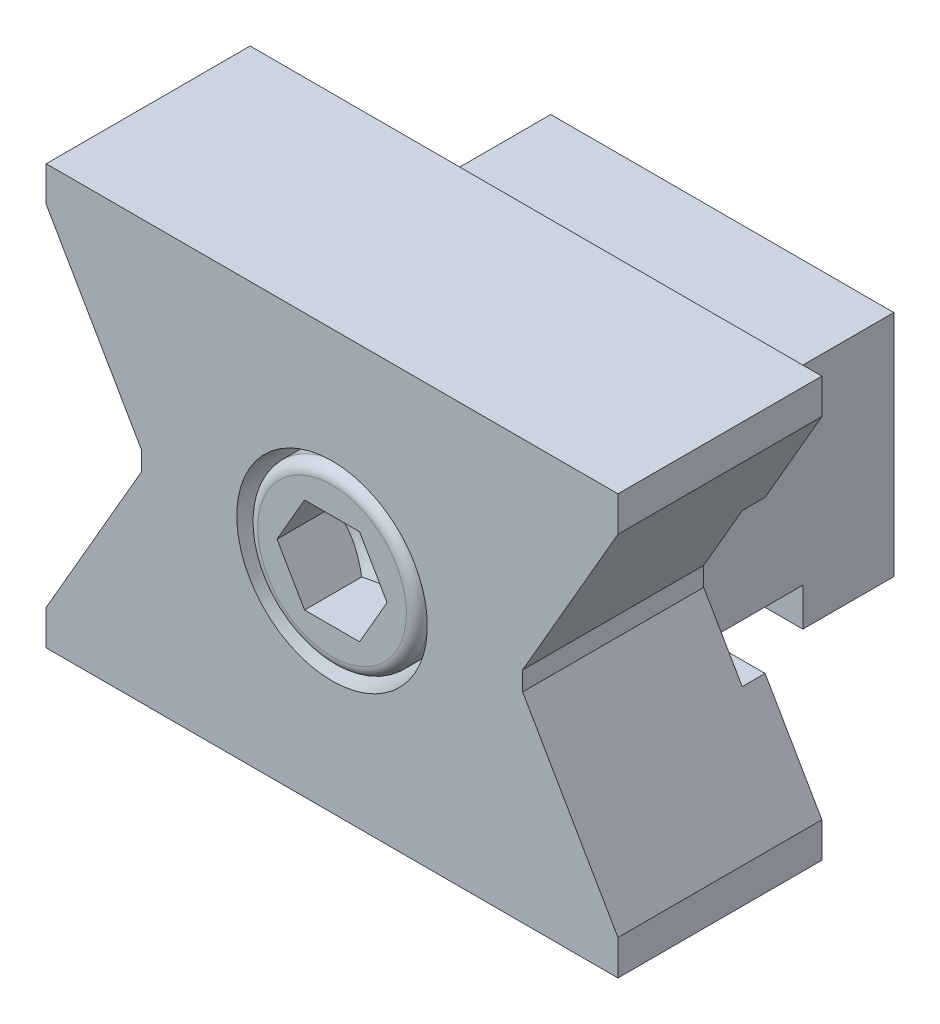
ISO-10303-21;
HEADER;
FILE_DESCRIPTION(('STEP AP214'),'2;1');
FILE_NAME('part.step','',(''),(''),'','','');
FILE_SCHEMA(('AUTOMOTIVE_DESIGN { 1 0 10303 214 1 1 1 1 }'));
ENDSEC;
DATA;
#1=APPLICATION_CONTEXT('core data for automotive mechanical design processes');
#2=APPLICATION_PROTOCOL_DEFINITION('international standard','automotive_design',2000,#1);
#3=PRODUCT_CONTEXT('',#1,'mechanical');
#4=PRODUCT('Part','Part','',(#3));
#5=PRODUCT_RELATED_PRODUCT_CATEGORY('part','',(#4));
#6=PRODUCT_DEFINITION_FORMATION('','',#4);
#7=PRODUCT_DEFINITION_CONTEXT('part definition',#1,'design');
#8=PRODUCT_DEFINITION('design','',#6,#7);
#9=PRODUCT_DEFINITION_SHAPE('','',#8);
#10=(LENGTH_UNIT() NAMED_UNIT(*) SI_UNIT(.MILLI.,.METRE.));
#11=(NAMED_UNIT(*) PLANE_ANGLE_UNIT() SI_UNIT($,.RADIAN.));
#12=(NAMED_UNIT(*) SI_UNIT($,.STERADIAN.) SOLID_ANGLE_UNIT());
#13=UNCERTAINTY_MEASURE_WITH_UNIT(LENGTH_MEASURE(1.E-05),#10,'distance_accuracy_value','');
#14=(GEOMETRIC_REPRESENTATION_CONTEXT(3) GLOBAL_UNCERTAINTY_ASSIGNED_CONTEXT((#13)) GLOBAL_UNIT_ASSIGNED_CONTEXT((#10,
#11,#12)) REPRESENTATION_CONTEXT('',''));
#15=CARTESIAN_POINT('',(0.,0.,0.));
#16=DIRECTION('',(0.,0.,1.));
#17=DIRECTION('',(1.,0.,0.));
#18=AXIS2_PLACEMENT_3D('',#15,#16,#17);
#19=CARTESIAN_POINT('',(0.,0.,-7.7875));
#20=DIRECTION('',(0.,0.,-1.));
#21=DIRECTION('',(-0.866025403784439,0.5,0.));
#22=AXIS2_PLACEMENT_3D('',#19,#20,#21);
#23=CYLINDRICAL_SURFACE('',#22,6.);
#24=CARTESIAN_POINT('',(0.,0.,2.00000000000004));
#25=DIRECTION('',(0.,0.,1.));
#26=DIRECTION('',(0.,-1.,0.));
#27=AXIS2_PLACEMENT_3D('',#24,#25,#26);
#28=CIRCLE('',#27,6.);
#29=CARTESIAN_POINT('',(0.,-5.99999999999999,2.00000000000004));
#30=VERTEX_POINT('',#29);
#31=EDGE_CURVE('E158',#30,#30,#28,.F.);
#32=ORIENTED_EDGE('',*,*,#31,.F.);
#33=EDGE_LOOP('',(#32));
#34=FACE_BOUND('',#33,.T.);
#35=CARTESIAN_POINT('',(0.,0.,2.4));
#36=DIRECTION('',(0.,0.,1.));
#37=DIRECTION('',(1.,0.,0.));
#38=AXIS2_PLACEMENT_3D('',#35,#36,#37);
#39=CIRCLE('',#38,6.);
#40=CARTESIAN_POINT('',(6.,0.,2.4));
#41=VERTEX_POINT('',#40);
#42=EDGE_CURVE('E18',#41,#41,#39,.F.);
#43=ORIENTED_EDGE('',*,*,#42,.T.);
#44=EDGE_LOOP('',(#43));
#45=FACE_BOUND('',#44,.T.);
#46=ADVANCED_FACE('F14',(#34,#45),#23,.T.);
#47=CARTESIAN_POINT('',(-20.,22.,21.4));
#48=DIRECTION('',(0.,0.,1.));
#49=DIRECTION('',(0.,-1.,0.));
#50=AXIS2_PLACEMENT_3D('',#47,#48,#49);
#51=PLANE('',#50);
#52=CARTESIAN_POINT('',(0.,0.,21.4));
#53=DIRECTION('',(0.,0.,1.));
#54=DIRECTION('',(0.,-1.,0.));
#55=AXIS2_PLACEMENT_3D('',#52,#53,#54);
#56=CIRCLE('',#55,10.);
#57=CARTESIAN_POINT('',(0.,-9.99999999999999,21.4));
#58=VERTEX_POINT('',#57);
#59=EDGE_CURVE('E223',#58,#58,#56,.F.);
#60=ORIENTED_EDGE('',*,*,#59,.T.);
#61=EDGE_LOOP('',(#60));
#62=FACE_BOUND('',#61,.T.);
#63=DIRECTION('',(-0.5,0.866025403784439,0.));
#64=VECTOR('',#63,1.);
#65=CARTESIAN_POINT('',(30.,-18.3205080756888,21.4));
#66=LINE('',#65,#64);
#67=CARTESIAN_POINT('',(30.,-18.3205080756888,21.4));
#68=VERTEX_POINT('',#67);
#69=CARTESIAN_POINT('',(20.,-0.999999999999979,21.4));
#70=VERTEX_POINT('',#69);
#71=EDGE_CURVE('E700',#68,#70,#66,.T.);
#72=ORIENTED_EDGE('',*,*,#71,.T.);
#73=DIRECTION('',(0.,-1.,0.));
#74=VECTOR('',#73,1.);
#75=CARTESIAN_POINT('',(20.,22.,21.4));
#76=LINE('',#75,#74);
#77=CARTESIAN_POINT('',(20.,1.00000000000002,21.4));
#78=VERTEX_POINT('',#77);
#79=EDGE_CURVE('E695',#70,#78,#76,.F.);
#80=ORIENTED_EDGE('',*,*,#79,.T.);
#81=DIRECTION('',(0.5,0.866025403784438,0.));
#82=VECTOR('',#81,1.);
#83=CARTESIAN_POINT('',(20.,1.00000000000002,21.4));
#84=LINE('',#83,#82);
#85=CARTESIAN_POINT('',(30.,18.3205080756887,21.4));
#86=VERTEX_POINT('',#85);
#87=EDGE_CURVE('E686',#78,#86,#84,.T.);
#88=ORIENTED_EDGE('',*,*,#87,.T.);
#89=DIRECTION('',(0.,-1.,0.));
#90=VECTOR('',#89,1.);
#91=CARTESIAN_POINT('',(30.,22.,21.4));
#92=LINE('',#91,#90);
#93=CARTESIAN_POINT('',(30.,22.,21.4));
#94=VERTEX_POINT('',#93);
#95=EDGE_CURVE('E684',#86,#94,#92,.F.);
#96=ORIENTED_EDGE('',*,*,#95,.T.);
#97=DIRECTION('',(1.,0.,0.));
#98=VECTOR('',#97,1.);
#99=CARTESIAN_POINT('',(-20.,22.,21.4));
#100=LINE('',#99,#98);
#101=CARTESIAN_POINT('',(-30.,22.,21.4));
#102=VERTEX_POINT('',#101);
#103=EDGE_CURVE('E722',#94,#102,#100,.F.);
#104=ORIENTED_EDGE('',*,*,#103,.T.);
#105=DIRECTION('',(0.,-1.,0.));
#106=VECTOR('',#105,1.);
#107=CARTESIAN_POINT('',(-30.,22.,21.4));
#108=LINE('',#107,#106);
#109=CARTESIAN_POINT('',(-30.,18.3205080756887,21.4));
#110=VERTEX_POINT('',#109);
#111=EDGE_CURVE('E719',#102,#110,#108,.T.);
#112=ORIENTED_EDGE('',*,*,#111,.T.);
#113=DIRECTION('',(0.5,-0.866025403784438,0.));
#114=VECTOR('',#113,1.);
#115=CARTESIAN_POINT('',(-30.,18.3205080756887,21.4));
#116=LINE('',#115,#114);
#117=CARTESIAN_POINT('',(-20.,1.00000000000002,21.4));
#118=VERTEX_POINT('',#117);
#119=EDGE_CURVE('E716',#110,#118,#116,.T.);
#120=ORIENTED_EDGE('',*,*,#119,.T.);
#121=DIRECTION('',(0.,-1.,0.));
#122=VECTOR('',#121,1.);
#123=CARTESIAN_POINT('',(-20.,22.,21.4));
#124=LINE('',#123,#122);
#125=CARTESIAN_POINT('',(-20.,-0.999999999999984,21.4));
#126=VERTEX_POINT('',#125);
#127=EDGE_CURVE('E713',#118,#126,#124,.T.);
#128=ORIENTED_EDGE('',*,*,#127,.T.);
#129=DIRECTION('',(-0.5,-0.866025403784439,0.));
#130=VECTOR('',#129,1.);
#131=CARTESIAN_POINT('',(-20.,-0.999999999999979,21.4));
#132=LINE('',#131,#130);
#133=CARTESIAN_POINT('',(-30.,-18.3205080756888,21.4));
#134=VERTEX_POINT('',#133);
#135=EDGE_CURVE('E711',#126,#134,#132,.T.);
#136=ORIENTED_EDGE('',*,*,#135,.T.);
#137=DIRECTION('',(0.,-1.,0.));
#138=VECTOR('',#137,1.);
#139=CARTESIAN_POINT('',(-30.,22.,21.4));
#140=LINE('',#139,#138);
#141=CARTESIAN_POINT('',(-30.,-22.,21.4));
#142=VERTEX_POINT('',#141);
#143=EDGE_CURVE('E646',#134,#142,#140,.T.);
#144=ORIENTED_EDGE('',*,*,#143,.T.);
#145=DIRECTION('',(1.,0.,0.));
#146=VECTOR('',#145,1.);
#147=CARTESIAN_POINT('',(-20.,-22.,21.4));
#148=LINE('',#147,#146);
#149=CARTESIAN_POINT('',(30.,-22.,21.4));
#150=VERTEX_POINT('',#149);
#151=EDGE_CURVE('E707',#142,#150,#148,.T.);
#152=ORIENTED_EDGE('',*,*,#151,.T.);
#153=DIRECTION('',(0.,-1.,0.));
#154=VECTOR('',#153,1.);
#155=CARTESIAN_POINT('',(30.,22.,21.4));
#156=LINE('',#155,#154);
#157=EDGE_CURVE('E703',#150,#68,#156,.F.);
#158=ORIENTED_EDGE('',*,*,#157,.T.);
#159=EDGE_LOOP('',(#72,#80,#88,#96,#104,#112,#120,#128,#136,#144,#152,#158));
#160=FACE_BOUND('',#159,.T.);
#161=ADVANCED_FACE('F397',(#62,#160),#51,.T.);
#162=CARTESIAN_POINT('',(0.,0.,15.4));
#163=DIRECTION('',(0.,0.,1.));
#164=DIRECTION('',(0.,-1.,0.));
#165=AXIS2_PLACEMENT_3D('',#162,#163,#164);
#166=CYLINDRICAL_SURFACE('',#165,10.);
#167=CARTESIAN_POINT('',(0.,0.,9.4));
#168=DIRECTION('',(0.,0.,1.));
#169=DIRECTION('',(0.,-1.,0.));
#170=AXIS2_PLACEMENT_3D('',#167,#168,#169);
#171=CIRCLE('',#170,10.);
#172=CARTESIAN_POINT('',(0.,-9.99999999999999,9.4));
#173=VERTEX_POINT('',#172);
#174=EDGE_CURVE('E226',#173,#173,#171,.T.);
#175=ORIENTED_EDGE('',*,*,#174,.F.);
#176=EDGE_LOOP('',(#175));
#177=FACE_BOUND('',#176,.T.);
#178=ORIENTED_EDGE('',*,*,#59,.F.);
#179=EDGE_LOOP('',(#178));
#180=FACE_BOUND('',#179,.T.);
#181=ADVANCED_FACE('F403',(#177,#180),#166,.F.);
#182=CARTESIAN_POINT('',(0.,0.,9.4));
#183=DIRECTION('',(0.,0.,1.));
#184=DIRECTION('',(0.,-1.,0.));
#185=AXIS2_PLACEMENT_3D('',#182,#183,#184);
#186=PLANE('',#185);
#187=ORIENTED_EDGE('',*,*,#174,.T.);
#188=EDGE_LOOP('',(#187));
#189=FACE_BOUND('',#188,.T.);
#190=CARTESIAN_POINT('',(0.,0.,9.4));
#191=DIRECTION('',(0.,0.,-1.));
#192=DIRECTION('',(-0.866025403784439,0.5,0.));
#193=AXIS2_PLACEMENT_3D('',#190,#191,#192);
#194=CIRCLE('',#193,9.);
#195=CARTESIAN_POINT('',(-7.79422863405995,4.50000000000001,9.4));
#196=VERTEX_POINT('',#195);
#197=EDGE_CURVE('E218',#196,#196,#194,.T.);
#198=ORIENTED_EDGE('',*,*,#197,.T.);
#199=EDGE_LOOP('',(#198));
#200=FACE_BOUND('',#199,.T.);
#201=ADVANCED_FACE('F784',(#189,#200),#186,.T.);
#202=CARTESIAN_POINT('',(-20.,1.00000000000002,21.4));
#203=DIRECTION('',(1.,0.,0.));
#204=DIRECTION('',(0.,0.,1.));
#205=AXIS2_PLACEMENT_3D('',#202,#203,#204);
#206=PLANE('',#205);
#207=DIRECTION('',(0.,0.,1.));
#208=VECTOR('',#207,1.);
#209=CARTESIAN_POINT('',(-20.,-0.999999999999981,21.4));
#210=LINE('',#209,#208);
#211=CARTESIAN_POINT('',(-20.,-0.99999999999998,2.4));
#212=VERTEX_POINT('',#211);
#213=EDGE_CURVE('E642',#212,#126,#210,.T.);
#214=ORIENTED_EDGE('',*,*,#213,.T.);
#215=ORIENTED_EDGE('',*,*,#127,.F.);
#216=DIRECTION('',(0.,0.,1.));
#217=VECTOR('',#216,1.);
#218=CARTESIAN_POINT('',(-20.,1.00000000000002,21.4));
#219=LINE('',#218,#217);
#220=CARTESIAN_POINT('',(-20.,1.00000000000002,2.4));
#221=VERTEX_POINT('',#220);
#222=EDGE_CURVE('E660',#221,#118,#219,.T.);
#223=ORIENTED_EDGE('',*,*,#222,.F.);
#224=DIRECTION('',(0.,-1.,0.));
#225=VECTOR('',#224,1.);
#226=CARTESIAN_POINT('',(-20.,1.00000000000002,2.4));
#227=LINE('',#226,#225);
#228=EDGE_CURVE('E657',#212,#221,#227,.F.);
#229=ORIENTED_EDGE('',*,*,#228,.F.);
#230=EDGE_LOOP('',(#214,#215,#223,#229));
#231=FACE_BOUND('',#230,.T.);
#232=ADVANCED_FACE('F754',(#231),#206,.F.);
#233=CARTESIAN_POINT('',(20.,1.00000000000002,21.4));
#234=DIRECTION('',(1.,0.,0.));
#235=DIRECTION('',(0.,0.,1.));
#236=AXIS2_PLACEMENT_3D('',#233,#234,#235);
#237=PLANE('',#236);
#238=ORIENTED_EDGE('',*,*,#79,.F.);
#239=DIRECTION('',(0.,0.,1.));
#240=VECTOR('',#239,1.);
#241=CARTESIAN_POINT('',(20.,-0.999999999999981,21.4));
#242=LINE('',#241,#240);
#243=CARTESIAN_POINT('',(20.,-0.999999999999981,2.4));
#244=VERTEX_POINT('',#243);
#245=EDGE_CURVE('E578',#70,#244,#242,.F.);
#246=ORIENTED_EDGE('',*,*,#245,.T.);
#247=DIRECTION('',(0.,-1.,0.));
#248=VECTOR('',#247,1.);
#249=CARTESIAN_POINT('',(20.,1.00000000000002,2.4));
#250=LINE('',#249,#248);
#251=CARTESIAN_POINT('',(20.,1.00000000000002,2.4));
#252=VERTEX_POINT('',#251);
#253=EDGE_CURVE('E697',#244,#252,#250,.F.);
#254=ORIENTED_EDGE('',*,*,#253,.T.);
#255=DIRECTION('',(0.,0.,1.));
#256=VECTOR('',#255,1.);
#257=CARTESIAN_POINT('',(20.,1.00000000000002,21.4));
#258=LINE('',#257,#256);
#259=EDGE_CURVE('E688',#252,#78,#258,.T.);
#260=ORIENTED_EDGE('',*,*,#259,.T.);
#261=EDGE_LOOP('',(#238,#246,#254,#260));
#262=FACE_BOUND('',#261,.T.);
#263=ADVANCED_FACE('F694',(#262),#237,.T.);
#264=CARTESIAN_POINT('',(-30.,11.,9.9));
#265=DIRECTION('',(1.,0.,0.));
#266=DIRECTION('',(0.,0.,1.));
#267=AXIS2_PLACEMENT_3D('',#264,#265,#266);
#268=PLANE('',#267);
#269=DIRECTION('',(0.,-1.,0.));
#270=VECTOR('',#269,1.);
#271=CARTESIAN_POINT('',(-30.,11.,0.));
#272=LINE('',#271,#270);
#273=CARTESIAN_POINT('',(-30.,-22.,0.));
#274=VERTEX_POINT('',#273);
#275=CARTESIAN_POINT('',(-30.,-18.3205080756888,0.));
#276=VERTEX_POINT('',#275);
#277=EDGE_CURVE('E629',#274,#276,#272,.F.);
#278=ORIENTED_EDGE('',*,*,#277,.F.);
#279=DIRECTION('',(0.,0.,1.));
#280=VECTOR('',#279,1.);
#281=CARTESIAN_POINT('',(-30.,-22.,-1.6));
#282=LINE('',#281,#280);
#283=EDGE_CURVE('E648',#274,#142,#282,.T.);
#284=ORIENTED_EDGE('',*,*,#283,.T.);
#285=ORIENTED_EDGE('',*,*,#143,.F.);
#286=DIRECTION('',(0.,0.,1.));
#287=VECTOR('',#286,1.);
#288=CARTESIAN_POINT('',(-30.,-18.3205080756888,9.9));
#289=LINE('',#288,#287);
#290=EDGE_CURVE('E634',#276,#134,#289,.T.);
#291=ORIENTED_EDGE('',*,*,#290,.F.);
#292=EDGE_LOOP('',(#278,#284,#285,#291));
#293=FACE_BOUND('',#292,.T.);
#294=ADVANCED_FACE('F644',(#293),#268,.F.);
#295=CARTESIAN_POINT('',(-20.,-22.,-1.6));
#296=DIRECTION('',(0.,1.,0.));
#297=DIRECTION('',(0.,0.,1.));
#298=AXIS2_PLACEMENT_3D('',#295,#296,#297);
#299=PLANE('',#298);
#300=DIRECTION('',(0.,0.,1.));
#301=VECTOR('',#300,1.);
#302=CARTESIAN_POINT('',(30.,-22.,9.9));
#303=LINE('',#302,#301);
#304=CARTESIAN_POINT('',(30.,-22.,0.));
#305=VERTEX_POINT('',#304);
#306=EDGE_CURVE('E741',#150,#305,#303,.F.);
#307=ORIENTED_EDGE('',*,*,#306,.F.);
#308=ORIENTED_EDGE('',*,*,#151,.F.);
#309=ORIENTED_EDGE('',*,*,#283,.F.);
#310=DIRECTION('',(1.,0.,0.));
#311=VECTOR('',#310,1.);
#312=CARTESIAN_POINT('',(-20.,-22.,0.));
#313=LINE('',#312,#311);
#314=EDGE_CURVE('E630',#305,#274,#313,.F.);
#315=ORIENTED_EDGE('',*,*,#314,.F.);
#316=EDGE_LOOP('',(#307,#308,#309,#315));
#317=FACE_BOUND('',#316,.T.);
#318=ADVANCED_FACE('F749',(#317),#299,.F.);
#319=CARTESIAN_POINT('',(30.,11.,9.9));
#320=DIRECTION('',(1.,0.,0.));
#321=DIRECTION('',(0.,0.,1.));
#322=AXIS2_PLACEMENT_3D('',#319,#320,#321);
#323=PLANE('',#322);
#324=ORIENTED_EDGE('',*,*,#306,.T.);
#325=DIRECTION('',(0.,-1.,0.));
#326=VECTOR('',#325,1.);
#327=CARTESIAN_POINT('',(30.,11.,0.));
#328=LINE('',#327,#326);
#329=CARTESIAN_POINT('',(30.,-18.3205080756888,0.));
#330=VERTEX_POINT('',#329);
#331=EDGE_CURVE('E739',#305,#330,#328,.F.);
#332=ORIENTED_EDGE('',*,*,#331,.T.);
#333=DIRECTION('',(0.,0.,1.));
#334=VECTOR('',#333,1.);
#335=CARTESIAN_POINT('',(30.,-18.3205080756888,21.4));
#336=LINE('',#335,#334);
#337=EDGE_CURVE('E734',#68,#330,#336,.F.);
#338=ORIENTED_EDGE('',*,*,#337,.F.);
#339=ORIENTED_EDGE('',*,*,#157,.F.);
#340=EDGE_LOOP('',(#324,#332,#338,#339));
#341=FACE_BOUND('',#340,.T.);
#342=ADVANCED_FACE('F745',(#341),#323,.T.);
#343=CARTESIAN_POINT('',(20.,-0.999999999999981,21.4));
#344=DIRECTION('',(0.866025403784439,0.5,0.));
#345=DIRECTION('',(-0.5,0.866025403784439,0.));
#346=AXIS2_PLACEMENT_3D('',#343,#344,#345);
#347=PLANE('',#346);
#348=DIRECTION('',(-0.5,0.866025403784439,0.));
#349=VECTOR('',#348,1.);
#350=CARTESIAN_POINT('',(20.,-0.999999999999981,0.));
#351=LINE('',#350,#349);
#352=CARTESIAN_POINT('',(24.0414518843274,-8.,0.));
#353=VERTEX_POINT('',#352);
#354=EDGE_CURVE('E731',#330,#353,#351,.T.);
#355=ORIENTED_EDGE('',*,*,#354,.T.);
#356=DIRECTION('',(0.,0.,1.));
#357=VECTOR('',#356,1.);
#358=CARTESIAN_POINT('',(24.0414518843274,-8.,21.4));
#359=LINE('',#358,#357);
#360=CARTESIAN_POINT('',(24.0414518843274,-8.,2.4));
#361=VERTEX_POINT('',#360);
#362=EDGE_CURVE('E728',#353,#361,#359,.T.);
#363=ORIENTED_EDGE('',*,*,#362,.T.);
#364=DIRECTION('',(-0.5,0.866025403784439,0.));
#365=VECTOR('',#364,1.);
#366=CARTESIAN_POINT('',(20.,-0.999999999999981,2.4));
#367=LINE('',#366,#365);
#368=EDGE_CURVE('E737',#361,#244,#367,.T.);
#369=ORIENTED_EDGE('',*,*,#368,.T.);
#370=ORIENTED_EDGE('',*,*,#245,.F.);
#371=ORIENTED_EDGE('',*,*,#71,.F.);
#372=ORIENTED_EDGE('',*,*,#337,.T.);
#373=EDGE_LOOP('',(#355,#363,#369,#370,#371,#372));
#374=FACE_BOUND('',#373,.T.);
#375=ADVANCED_FACE('F750',(#374),#347,.T.);
#376=CARTESIAN_POINT('',(-20.,8.,2.4));
#377=DIRECTION('',(0.,0.,1.));
#378=DIRECTION('',(0.,-1.,0.));
#379=AXIS2_PLACEMENT_3D('',#376,#377,#378);
#380=PLANE('',#379);
#381=ORIENTED_EDGE('',*,*,#368,.F.);
#382=DIRECTION('',(1.,0.,0.));
#383=VECTOR('',#382,1.);
#384=CARTESIAN_POINT('',(-20.,-8.,2.4));
#385=LINE('',#384,#383);
#386=CARTESIAN_POINT('',(-24.0414518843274,-8.,2.4));
#387=VERTEX_POINT('',#386);
#388=EDGE_CURVE('E516',#387,#361,#385,.T.);
#389=ORIENTED_EDGE('',*,*,#388,.F.);
#390=DIRECTION('',(0.5,0.866025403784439,0.));
#391=VECTOR('',#390,1.);
#392=CARTESIAN_POINT('',(-20.,-0.999999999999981,2.4));
#393=LINE('',#392,#391);
#394=EDGE_CURVE('E635',#387,#212,#393,.T.);
#395=ORIENTED_EDGE('',*,*,#394,.T.);
#396=ORIENTED_EDGE('',*,*,#228,.T.);
#397=DIRECTION('',(-0.5,0.866025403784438,0.));
#398=VECTOR('',#397,1.);
#399=CARTESIAN_POINT('',(-30.,18.3205080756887,2.4));
#400=LINE('',#399,#398);
#401=CARTESIAN_POINT('',(-24.0414518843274,8.,2.4));
#402=VERTEX_POINT('',#401);
#403=EDGE_CURVE('E662',#221,#402,#400,.T.);
#404=ORIENTED_EDGE('',*,*,#403,.T.);
#405=DIRECTION('',(1.,0.,0.));
#406=VECTOR('',#405,1.);
#407=CARTESIAN_POINT('',(-20.,8.,2.4));
#408=LINE('',#407,#406);
#409=CARTESIAN_POINT('',(24.0414518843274,8.,2.4));
#410=VERTEX_POINT('',#409);
#411=EDGE_CURVE('E522',#410,#402,#408,.F.);
#412=ORIENTED_EDGE('',*,*,#411,.F.);
#413=DIRECTION('',(0.5,0.866025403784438,0.));
#414=VECTOR('',#413,1.);
#415=CARTESIAN_POINT('',(30.,18.3205080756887,2.4));
#416=LINE('',#415,#414);
#417=EDGE_CURVE('E514',#252,#410,#416,.T.);
#418=ORIENTED_EDGE('',*,*,#417,.F.);
#419=ORIENTED_EDGE('',*,*,#253,.F.);
#420=EDGE_LOOP('',(#381,#389,#395,#396,#404,#412,#418,#419));
#421=FACE_BOUND('',#420,.T.);
#422=ORIENTED_EDGE('',*,*,#42,.F.);
#423=EDGE_LOOP('',(#422));
#424=FACE_BOUND('',#423,.T.);
#425=ADVANCED_FACE('F758',(#421,#424),#380,.F.);
#426=CARTESIAN_POINT('',(-20.,-0.999999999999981,21.4));
#427=DIRECTION('',(0.866025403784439,-0.5,0.));
#428=DIRECTION('',(0.5,0.866025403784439,0.));
#429=AXIS2_PLACEMENT_3D('',#426,#427,#428);
#430=PLANE('',#429);
#431=DIRECTION('',(0.,0.,1.));
#432=VECTOR('',#431,1.);
#433=CARTESIAN_POINT('',(-24.0414518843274,-8.,21.4));
#434=LINE('',#433,#432);
#435=CARTESIAN_POINT('',(-24.0414518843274,-8.,0.));
#436=VERTEX_POINT('',#435);
#437=EDGE_CURVE('E543',#436,#387,#434,.T.);
#438=ORIENTED_EDGE('',*,*,#437,.F.);
#439=DIRECTION('',(0.5,0.866025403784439,0.));
#440=VECTOR('',#439,1.);
#441=CARTESIAN_POINT('',(-20.,-0.999999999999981,0.));
#442=LINE('',#441,#440);
#443=EDGE_CURVE('E538',#276,#436,#442,.T.);
#444=ORIENTED_EDGE('',*,*,#443,.F.);
#445=ORIENTED_EDGE('',*,*,#290,.T.);
#446=ORIENTED_EDGE('',*,*,#135,.F.);
#447=ORIENTED_EDGE('',*,*,#213,.F.);
#448=ORIENTED_EDGE('',*,*,#394,.F.);
#449=EDGE_LOOP('',(#438,#444,#445,#446,#447,#448));
#450=FACE_BOUND('',#449,.T.);
#451=ADVANCED_FACE('F638',(#450),#430,.F.);
#452=CARTESIAN_POINT('',(-20.,-22.,0.));
#453=DIRECTION('',(0.,0.,1.));
#454=DIRECTION('',(0.,-1.,0.));
#455=AXIS2_PLACEMENT_3D('',#452,#453,#454);
#456=PLANE('',#455);
#457=ORIENTED_EDGE('',*,*,#331,.F.);
#458=ORIENTED_EDGE('',*,*,#314,.T.);
#459=ORIENTED_EDGE('',*,*,#277,.T.);
#460=ORIENTED_EDGE('',*,*,#443,.T.);
#461=DIRECTION('',(1.,0.,0.));
#462=VECTOR('',#461,1.);
#463=CARTESIAN_POINT('',(-20.,-8.,0.));
#464=LINE('',#463,#462);
#465=CARTESIAN_POINT('',(-18.,-8.,0.));
#466=VERTEX_POINT('',#465);
#467=EDGE_CURVE('E483',#466,#436,#464,.F.);
#468=ORIENTED_EDGE('',*,*,#467,.F.);
#469=CARTESIAN_POINT('',(18.,-8.,0.));
#470=VERTEX_POINT('',#469);
#471=EDGE_CURVE('E487',#470,#466,#464,.F.);
#472=ORIENTED_EDGE('',*,*,#471,.F.);
#473=EDGE_CURVE('E489',#353,#470,#464,.F.);
#474=ORIENTED_EDGE('',*,*,#473,.F.);
#475=ORIENTED_EDGE('',*,*,#354,.F.);
#476=EDGE_LOOP('',(#457,#458,#459,#460,#468,#472,#474,#475));
#477=FACE_BOUND('',#476,.T.);
#478=ADVANCED_FACE('F534',(#477),#456,.F.);
#479=CARTESIAN_POINT('',(-20.,-8.,-1.6));
#480=DIRECTION('',(0.,1.,0.));
#481=DIRECTION('',(0.,0.,1.));
#482=AXIS2_PLACEMENT_3D('',#479,#480,#481);
#483=PLANE('',#482);
#484=DIRECTION('',(0.,0.,1.));
#485=VECTOR('',#484,1.);
#486=CARTESIAN_POINT('',(18.,-8.,-9.49031612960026));
#487=LINE('',#486,#485);
#488=CARTESIAN_POINT('',(18.,-8.,2.00000000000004));
#489=VERTEX_POINT('',#488);
#490=EDGE_CURVE('E200',#489,#470,#487,.F.);
#491=ORIENTED_EDGE('',*,*,#490,.F.);
#492=DIRECTION('',(1.,0.,0.));
#493=VECTOR('',#492,1.);
#494=CARTESIAN_POINT('',(-20.,-8.,2.00000000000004));
#495=LINE('',#494,#493);
#496=CARTESIAN_POINT('',(-18.,-8.,2.00000000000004));
#497=VERTEX_POINT('',#496);
#498=EDGE_CURVE('E214',#497,#489,#495,.T.);
#499=ORIENTED_EDGE('',*,*,#498,.F.);
#500=DIRECTION('',(0.,0.,1.));
#501=VECTOR('',#500,1.);
#502=CARTESIAN_POINT('',(-18.,-8.,-1.6));
#503=LINE('',#502,#501);
#504=EDGE_CURVE('E217',#466,#497,#503,.T.);
#505=ORIENTED_EDGE('',*,*,#504,.F.);
#506=ORIENTED_EDGE('',*,*,#467,.T.);
#507=ORIENTED_EDGE('',*,*,#437,.T.);
#508=ORIENTED_EDGE('',*,*,#388,.T.);
#509=ORIENTED_EDGE('',*,*,#362,.F.);
#510=ORIENTED_EDGE('',*,*,#473,.T.);
#511=EDGE_LOOP('',(#491,#499,#505,#506,#507,#508,#509,#510));
#512=FACE_BOUND('',#511,.T.);
#513=ADVANCED_FACE('F541',(#512),#483,.T.);
#514=CARTESIAN_POINT('',(30.,18.3205080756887,21.4));
#515=DIRECTION('',(0.866025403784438,-0.5,0.));
#516=DIRECTION('',(0.5,0.866025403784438,0.));
#517=AXIS2_PLACEMENT_3D('',#514,#515,#516);
#518=PLANE('',#517);
#519=ORIENTED_EDGE('',*,*,#87,.F.);
#520=ORIENTED_EDGE('',*,*,#259,.F.);
#521=ORIENTED_EDGE('',*,*,#417,.T.);
#522=DIRECTION('',(0.,0.,1.));
#523=VECTOR('',#522,1.);
#524=CARTESIAN_POINT('',(24.0414518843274,8.,21.4));
#525=LINE('',#524,#523);
#526=CARTESIAN_POINT('',(24.0414518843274,8.,0.));
#527=VERTEX_POINT('',#526);
#528=EDGE_CURVE('E495',#410,#527,#525,.F.);
#529=ORIENTED_EDGE('',*,*,#528,.T.);
#530=DIRECTION('',(0.5,0.866025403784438,0.));
#531=VECTOR('',#530,1.);
#532=CARTESIAN_POINT('',(30.,18.3205080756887,0.));
#533=LINE('',#532,#531);
#534=CARTESIAN_POINT('',(30.,18.3205080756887,0.));
#535=VERTEX_POINT('',#534);
#536=EDGE_CURVE('E501',#527,#535,#533,.T.);
#537=ORIENTED_EDGE('',*,*,#536,.T.);
#538=DIRECTION('',(0.,0.,1.));
#539=VECTOR('',#538,1.);
#540=CARTESIAN_POINT('',(30.,18.3205080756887,9.9));
#541=LINE('',#540,#539);
#542=EDGE_CURVE('E508',#86,#535,#541,.F.);
#543=ORIENTED_EDGE('',*,*,#542,.F.);
#544=EDGE_LOOP('',(#519,#520,#521,#529,#537,#543));
#545=FACE_BOUND('',#544,.T.);
#546=ADVANCED_FACE('F511',(#545),#518,.T.);
#547=CARTESIAN_POINT('',(30.,11.,9.9));
#548=DIRECTION('',(1.,0.,0.));
#549=DIRECTION('',(0.,0.,1.));
#550=AXIS2_PLACEMENT_3D('',#547,#548,#549);
#551=PLANE('',#550);
#552=DIRECTION('',(0.,0.,1.));
#553=VECTOR('',#552,1.);
#554=CARTESIAN_POINT('',(30.,22.,-1.6));
#555=LINE('',#554,#553);
#556=CARTESIAN_POINT('',(30.,22.,0.));
#557=VERTEX_POINT('',#556);
#558=EDGE_CURVE('E674',#94,#557,#555,.F.);
#559=ORIENTED_EDGE('',*,*,#558,.F.);
#560=ORIENTED_EDGE('',*,*,#95,.F.);
#561=ORIENTED_EDGE('',*,*,#542,.T.);
#562=DIRECTION('',(0.,-1.,0.));
#563=VECTOR('',#562,1.);
#564=CARTESIAN_POINT('',(30.,11.,0.));
#565=LINE('',#564,#563);
#566=EDGE_CURVE('E504',#535,#557,#565,.F.);
#567=ORIENTED_EDGE('',*,*,#566,.T.);
#568=EDGE_LOOP('',(#559,#560,#561,#567));
#569=FACE_BOUND('',#568,.T.);
#570=ADVANCED_FACE('F682',(#569),#551,.T.);
#571=CARTESIAN_POINT('',(-20.,22.,-1.6));
#572=DIRECTION('',(0.,1.,0.));
#573=DIRECTION('',(0.,0.,1.));
#574=AXIS2_PLACEMENT_3D('',#571,#572,#573);
#575=PLANE('',#574);
#576=ORIENTED_EDGE('',*,*,#103,.F.);
#577=ORIENTED_EDGE('',*,*,#558,.T.);
#578=DIRECTION('',(1.,0.,0.));
#579=VECTOR('',#578,1.);
#580=CARTESIAN_POINT('',(-20.,22.,0.));
#581=LINE('',#580,#579);
#582=CARTESIAN_POINT('',(-30.,22.,0.));
#583=VERTEX_POINT('',#582);
#584=EDGE_CURVE('E677',#557,#583,#581,.F.);
#585=ORIENTED_EDGE('',*,*,#584,.T.);
#586=DIRECTION('',(0.,0.,1.));
#587=VECTOR('',#586,1.);
#588=CARTESIAN_POINT('',(-30.,22.,9.9));
#589=LINE('',#588,#587);
#590=EDGE_CURVE('E670',#583,#102,#589,.T.);
#591=ORIENTED_EDGE('',*,*,#590,.T.);
#592=EDGE_LOOP('',(#576,#577,#585,#591));
#593=FACE_BOUND('',#592,.T.);
#594=ADVANCED_FACE('F771',(#593),#575,.T.);
#595=CARTESIAN_POINT('',(-30.,11.,9.9));
#596=DIRECTION('',(1.,0.,0.));
#597=DIRECTION('',(0.,0.,1.));
#598=AXIS2_PLACEMENT_3D('',#595,#596,#597);
#599=PLANE('',#598);
#600=ORIENTED_EDGE('',*,*,#111,.F.);
#601=ORIENTED_EDGE('',*,*,#590,.F.);
#602=DIRECTION('',(0.,-1.,0.));
#603=VECTOR('',#602,1.);
#604=CARTESIAN_POINT('',(-30.,11.,0.));
#605=LINE('',#604,#603);
#606=CARTESIAN_POINT('',(-30.,18.3205080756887,0.));
#607=VERTEX_POINT('',#606);
#608=EDGE_CURVE('E672',#607,#583,#605,.F.);
#609=ORIENTED_EDGE('',*,*,#608,.F.);
#610=DIRECTION('',(0.,0.,1.));
#611=VECTOR('',#610,1.);
#612=CARTESIAN_POINT('',(-30.,18.3205080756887,21.4));
#613=LINE('',#612,#611);
#614=EDGE_CURVE('E665',#607,#110,#613,.T.);
#615=ORIENTED_EDGE('',*,*,#614,.T.);
#616=EDGE_LOOP('',(#600,#601,#609,#615));
#617=FACE_BOUND('',#616,.T.);
#618=ADVANCED_FACE('F768',(#617),#599,.F.);
#619=CARTESIAN_POINT('',(-30.,18.3205080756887,21.4));
#620=DIRECTION('',(0.866025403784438,0.5,0.));
#621=DIRECTION('',(-0.5,0.866025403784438,0.));
#622=AXIS2_PLACEMENT_3D('',#619,#620,#621);
#623=PLANE('',#622);
#624=ORIENTED_EDGE('',*,*,#222,.T.);
#625=ORIENTED_EDGE('',*,*,#119,.F.);
#626=ORIENTED_EDGE('',*,*,#614,.F.);
#627=DIRECTION('',(-0.5,0.866025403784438,0.));
#628=VECTOR('',#627,1.);
#629=CARTESIAN_POINT('',(-30.,18.3205080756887,0.));
#630=LINE('',#629,#628);
#631=CARTESIAN_POINT('',(-24.0414518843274,8.,0.));
#632=VERTEX_POINT('',#631);
#633=EDGE_CURVE('E667',#632,#607,#630,.T.);
#634=ORIENTED_EDGE('',*,*,#633,.F.);
#635=DIRECTION('',(0.,0.,1.));
#636=VECTOR('',#635,1.);
#637=CARTESIAN_POINT('',(-24.0414518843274,8.,21.4));
#638=LINE('',#637,#636);
#639=EDGE_CURVE('E479',#402,#632,#638,.F.);
#640=ORIENTED_EDGE('',*,*,#639,.F.);
#641=ORIENTED_EDGE('',*,*,#403,.F.);
#642=EDGE_LOOP('',(#624,#625,#626,#634,#640,#641));
#643=FACE_BOUND('',#642,.T.);
#644=ADVANCED_FACE('F761',(#643),#623,.F.);
#645=CARTESIAN_POINT('',(-20.,8.,-1.6));
#646=DIRECTION('',(0.,1.,0.));
#647=DIRECTION('',(0.,0.,1.));
#648=AXIS2_PLACEMENT_3D('',#645,#646,#647);
#649=PLANE('',#648);
#650=DIRECTION('',(1.,0.,0.));
#651=VECTOR('',#650,1.);
#652=CARTESIAN_POINT('',(-20.,8.,2.00000000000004));
#653=LINE('',#652,#651);
#654=CARTESIAN_POINT('',(-18.,8.,2.00000000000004));
#655=VERTEX_POINT('',#654);
#656=CARTESIAN_POINT('',(18.,8.,2.00000000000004));
#657=VERTEX_POINT('',#656);
#658=EDGE_CURVE('E32',#655,#657,#653,.T.);
#659=ORIENTED_EDGE('',*,*,#658,.T.);
#660=DIRECTION('',(0.,0.,-1.));
#661=VECTOR('',#660,1.);
#662=CARTESIAN_POINT('',(18.,8.,-1.6));
#663=LINE('',#662,#661);
#664=CARTESIAN_POINT('',(18.,8.,0.));
#665=VERTEX_POINT('',#664);
#666=EDGE_CURVE('E9',#657,#665,#663,.T.);
#667=ORIENTED_EDGE('',*,*,#666,.T.);
#668=DIRECTION('',(1.,0.,0.));
#669=VECTOR('',#668,1.);
#670=CARTESIAN_POINT('',(-20.,8.,0.));
#671=LINE('',#670,#669);
#672=EDGE_CURVE('E485',#665,#527,#671,.T.);
#673=ORIENTED_EDGE('',*,*,#672,.T.);
#674=ORIENTED_EDGE('',*,*,#528,.F.);
#675=ORIENTED_EDGE('',*,*,#411,.T.);
#676=ORIENTED_EDGE('',*,*,#639,.T.);
#677=CARTESIAN_POINT('',(-18.,8.,0.));
#678=VERTEX_POINT('',#677);
#679=EDGE_CURVE('E475',#632,#678,#671,.T.);
#680=ORIENTED_EDGE('',*,*,#679,.T.);
#681=DIRECTION('',(0.,0.,1.));
#682=VECTOR('',#681,1.);
#683=CARTESIAN_POINT('',(-18.,8.,-1.6));
#684=LINE('',#683,#682);
#685=EDGE_CURVE('E24',#678,#655,#684,.T.);
#686=ORIENTED_EDGE('',*,*,#685,.T.);
#687=EDGE_LOOP('',(#659,#667,#673,#674,#675,#676,#680,#686));
#688=FACE_BOUND('',#687,.T.);
#689=ADVANCED_FACE('F410',(#688),#649,.F.);
#690=CARTESIAN_POINT('',(-20.,-22.,0.));
#691=DIRECTION('',(0.,0.,1.));
#692=DIRECTION('',(0.,-1.,0.));
#693=AXIS2_PLACEMENT_3D('',#690,#691,#692);
#694=PLANE('',#693);
#695=ORIENTED_EDGE('',*,*,#679,.F.);
#696=ORIENTED_EDGE('',*,*,#633,.T.);
#697=ORIENTED_EDGE('',*,*,#608,.T.);
#698=ORIENTED_EDGE('',*,*,#584,.F.);
#699=ORIENTED_EDGE('',*,*,#566,.F.);
#700=ORIENTED_EDGE('',*,*,#536,.F.);
#701=ORIENTED_EDGE('',*,*,#672,.F.);
#702=EDGE_CURVE('E136',#678,#665,#671,.T.);
#703=ORIENTED_EDGE('',*,*,#702,.F.);
#704=EDGE_LOOP('',(#695,#696,#697,#698,#699,#700,#701,#703));
#705=FACE_BOUND('',#704,.T.);
#706=ADVANCED_FACE('F353',(#705),#694,.F.);
#707=CARTESIAN_POINT('',(0.,0.,15.4199999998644));
#708=DIRECTION('',(0.,0.,1.));
#709=DIRECTION('',(0.5,0.866025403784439,0.));
#710=AXIS2_PLACEMENT_3D('',#707,#708,#709);
#711=CONICAL_SURFACE('',#710,5.80814370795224,1.04719755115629);
#712=CARTESIAN_POINT('',(9.84594350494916E-11,-5.68312757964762E-11,12.0666666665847));
#713=VERTEX_POINT('',#712);
#714=VERTEX_LOOP('',#713);
#715=FACE_BOUND('',#714,.T.);
#716=CARTESIAN_POINT('',(-2.88675134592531,5.0000000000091,15.3999999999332));
#717=CARTESIAN_POINT('',(-3.01361322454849,4.78026878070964,15.3267433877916));
#718=CARTESIAN_POINT('',(-3.14156016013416,4.55865818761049,15.2601139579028));
#719=CARTESIAN_POINT('',(-3.39966938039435,4.1115999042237,15.1438136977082));
#720=CARTESIAN_POINT('',(-3.52983624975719,3.88614427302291,15.0941840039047));
#721=CARTESIAN_POINT('',(-3.78857671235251,3.43799264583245,15.0169443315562));
#722=CARTESIAN_POINT('',(-3.91711001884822,3.21536642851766,14.9888198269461));
#723=CARTESIAN_POINT('',(-4.11036193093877,2.88064429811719,14.9636032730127));
#724=CARTESIAN_POINT('',(-4.17482329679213,2.76899393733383,14.9580247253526));
#725=CARTESIAN_POINT('',(-4.30380553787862,2.5455901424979,14.9526191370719));
#726=CARTESIAN_POINT('',(-4.36832641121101,2.4338367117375,14.9527919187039));
#727=CARTESIAN_POINT('',(-4.54508051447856,2.12768962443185,14.9611797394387));
#728=CARTESIAN_POINT('',(-4.6572551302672,1.93339749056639,14.975256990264));
#729=CARTESIAN_POINT('',(-4.88085989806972,1.54610267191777,15.0198894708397));
#730=CARTESIAN_POINT('',(-4.99228926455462,1.35310134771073,15.0504599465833));
#731=CARTESIAN_POINT('',(-5.21634426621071,0.965026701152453,15.1268756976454));
#732=CARTESIAN_POINT('',(-5.3289416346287,0.77000233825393,15.1730446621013));
#733=CARTESIAN_POINT('',(-5.55245747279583,0.382861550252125,15.2778288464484));
#734=CARTESIAN_POINT('',(-5.66337880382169,0.190740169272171,15.3364194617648));
#735=CARTESIAN_POINT('',(-5.77350269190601,-1.68894846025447E-11,15.3999999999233));
#736=B_SPLINE_CURVE_WITH_KNOTS('',3,(#716,#717,#718,#719,#720,#721,#722,#723,#724,#725,#726,
#727,#728,#729,#730,#731,#732,#733,#734,#735),.UNSPECIFIED.,.F.,.F.,(4,2,2,2,2,2,2,2,2,4),(0.,
0.792540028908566,1.58698454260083,2.36176901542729,2.74878733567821,3.13579369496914,
3.80946092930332,4.48375195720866,5.17299552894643,5.86088640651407),.UNSPECIFIED.);
#737=CARTESIAN_POINT('',(-2.88675134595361,5.00000000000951,15.399999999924));
#738=VERTEX_POINT('',#737);
#739=CARTESIAN_POINT('',(-5.77350269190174,-9.48568480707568E-12,15.3999999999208));
#740=VERTEX_POINT('',#739);
#741=EDGE_CURVE('E163',#738,#740,#736,.T.);
#742=ORIENTED_EDGE('',*,*,#741,.T.);
#743=CARTESIAN_POINT('',(-5.77350269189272,2.43184378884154E-11,15.3999999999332));
#744=CARTESIAN_POINT('',(-5.64664081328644,-0.219731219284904,15.3267433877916));
#745=CARTESIAN_POINT('',(-5.51869387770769,-0.441341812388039,15.2601139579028));
#746=CARTESIAN_POINT('',(-5.26058465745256,-0.88840009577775,15.1438136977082));
#747=CARTESIAN_POINT('',(-5.13041778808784,-1.11385572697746,15.0941840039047));
#748=CARTESIAN_POINT('',(-4.87167732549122,-1.56200735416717,15.0169443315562));
#749=CARTESIAN_POINT('',(-4.74314401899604,-1.78463357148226,14.9888198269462));
#750=CARTESIAN_POINT('',(-4.54989210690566,-2.11935570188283,14.9636032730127));
#751=CARTESIAN_POINT('',(-4.48543074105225,-2.23100606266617,14.9580247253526));
#752=CARTESIAN_POINT('',(-4.35644849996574,-2.45440985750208,14.9526191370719));
#753=CARTESIAN_POINT('',(-4.29192762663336,-2.56616328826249,14.9527919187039));
#754=CARTESIAN_POINT('',(-4.11517352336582,-2.87231037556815,14.9611797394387));
#755=CARTESIAN_POINT('',(-4.00299890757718,-3.0666025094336,14.975256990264));
#756=CARTESIAN_POINT('',(-3.77939413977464,-3.45389732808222,15.0198894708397));
#757=CARTESIAN_POINT('',(-3.66796477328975,-3.64689865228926,15.0504599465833));
#758=CARTESIAN_POINT('',(-3.44390977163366,-4.03497329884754,15.1268756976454));
#759=CARTESIAN_POINT('',(-3.33131240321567,-4.22999766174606,15.1730446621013));
#760=CARTESIAN_POINT('',(-3.10779656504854,-4.61713844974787,15.2778288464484));
#761=CARTESIAN_POINT('',(-2.99687523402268,-4.80925983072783,15.3364194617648));
#762=CARTESIAN_POINT('',(-2.88675134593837,-5.00000000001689,15.3999999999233));
#763=B_SPLINE_CURVE_WITH_KNOTS('',3,(#743,#744,#745,#746,#747,#748,#749,#750,#751,#752,#753,
#754,#755,#756,#757,#758,#759,#760,#761,#762),.UNSPECIFIED.,.F.,.F.,(4,2,2,2,2,2,2,2,2,4),(0.,
0.792540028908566,1.58698454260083,2.36176901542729,2.74878733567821,3.13579369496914,
3.80946092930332,4.48375195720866,5.17299552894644,5.86088640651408),.UNSPECIFIED.);
#764=CARTESIAN_POINT('',(-2.88675134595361,-5.00000000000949,15.399999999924));
#765=VERTEX_POINT('',#764);
#766=EDGE_CURVE('E273',#740,#765,#763,.T.);
#767=ORIENTED_EDGE('',*,*,#766,.T.);
#768=CARTESIAN_POINT('',(-2.8867513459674,-4.99999999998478,15.3999999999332));
#769=CARTESIAN_POINT('',(-2.63302758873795,-4.99999999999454,15.3267433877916));
#770=CARTESIAN_POINT('',(-2.37713371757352,-4.99999999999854,15.2601139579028));
#771=CARTESIAN_POINT('',(-1.8609152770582,-5.00000000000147,15.1438136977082));
#772=CARTESIAN_POINT('',(-1.60058153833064,-5.00000000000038,15.0941840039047));
#773=CARTESIAN_POINT('',(-1.08310061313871,-4.99999999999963,15.0169443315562));
#774=CARTESIAN_POINT('',(-0.826034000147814,-4.99999999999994,14.9888198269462));
#775=CARTESIAN_POINT('',(-0.439530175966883,-5.00000000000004,14.9636032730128));
#776=CARTESIAN_POINT('',(-0.310607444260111,-5.00000000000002,14.9580247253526));
#777=CARTESIAN_POINT('',(-0.0526429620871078,-4.99999999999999,14.9526191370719));
#778=CARTESIAN_POINT('',(0.0763987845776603,-5.,14.9527919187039));
#779=CARTESIAN_POINT('',(0.429906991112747,-5.,14.9611797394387));
#780=CARTESIAN_POINT('',(0.654256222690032,-5.,14.975256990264));
#781=CARTESIAN_POINT('',(1.10146575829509,-5.,15.0198894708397));
#782=CARTESIAN_POINT('',(1.32432449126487,-5.00000000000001,15.0504599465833));
#783=CARTESIAN_POINT('',(1.77243449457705,-5.00000000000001,15.1268756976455));
#784=CARTESIAN_POINT('',(1.99762923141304,-5.00000000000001,15.1730446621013));
#785=CARTESIAN_POINT('',(2.44466090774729,-5.,15.2778288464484));
#786=CARTESIAN_POINT('',(2.66650356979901,-5.,15.3364194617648));
#787=CARTESIAN_POINT('',(2.88675134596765,-5.,15.3999999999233));
#788=B_SPLINE_CURVE_WITH_KNOTS('',3,(#768,#769,#770,#771,#772,#773,#774,#775,#776,#777,#778,
#779,#780,#781,#782,#783,#784,#785,#786,#787),.UNSPECIFIED.,.F.,.F.,(4,2,2,2,2,2,2,2,2,4),(0.,
0.792540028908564,1.58698454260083,2.36176901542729,2.74878733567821,3.13579369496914,
3.80946092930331,4.48375195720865,5.17299552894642,5.86088640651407),.UNSPECIFIED.);
#789=CARTESIAN_POINT('',(2.88675134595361,-5.00000000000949,15.399999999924));
#790=VERTEX_POINT('',#789);
#791=EDGE_CURVE('E278',#765,#790,#788,.T.);
#792=ORIENTED_EDGE('',*,*,#791,.T.);
#793=CARTESIAN_POINT('',(2.88675134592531,-5.00000000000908,15.3999999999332));
#794=CARTESIAN_POINT('',(3.0136132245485,-4.78026878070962,15.3267433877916));
#795=CARTESIAN_POINT('',(3.14156016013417,-4.55865818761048,15.2601139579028));
#796=CARTESIAN_POINT('',(3.39966938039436,-4.11159990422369,15.1438136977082));
#797=CARTESIAN_POINT('',(3.5298362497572,-3.8861442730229,15.0941840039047));
#798=CARTESIAN_POINT('',(3.78857671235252,-3.43799264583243,15.0169443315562));
#799=CARTESIAN_POINT('',(3.91711001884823,-3.21536642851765,14.9888198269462));
#800=CARTESIAN_POINT('',(4.11036193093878,-2.88064429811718,14.9636032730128));
#801=CARTESIAN_POINT('',(4.17482329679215,-2.76899393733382,14.9580247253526));
#802=CARTESIAN_POINT('',(4.30380553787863,-2.54559014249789,14.9526191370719));
#803=CARTESIAN_POINT('',(4.36832641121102,-2.43383671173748,14.9527919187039));
#804=CARTESIAN_POINT('',(4.54508051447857,-2.12768962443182,14.9611797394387));
#805=CARTESIAN_POINT('',(4.65725513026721,-1.93339749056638,14.975256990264));
#806=CARTESIAN_POINT('',(4.88085989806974,-1.54610267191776,15.0198894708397));
#807=CARTESIAN_POINT('',(4.99228926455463,-1.35310134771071,15.0504599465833));
#808=CARTESIAN_POINT('',(5.21634426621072,-0.965026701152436,15.1268756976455));
#809=CARTESIAN_POINT('',(5.32894163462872,-0.770002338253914,15.1730446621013));
#810=CARTESIAN_POINT('',(5.55245747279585,-0.382861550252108,15.2778288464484));
#811=CARTESIAN_POINT('',(5.66337880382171,-0.190740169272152,15.3364194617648));
#812=CARTESIAN_POINT('',(5.77350269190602,1.69129033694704E-11,15.3999999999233));
#813=B_SPLINE_CURVE_WITH_KNOTS('',3,(#793,#794,#795,#796,#797,#798,#799,#800,#801,#802,#803,
#804,#805,#806,#807,#808,#809,#810,#811,#812),.UNSPECIFIED.,.F.,.F.,(4,2,2,2,2,2,2,2,2,4),(0.,
0.792540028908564,1.58698454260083,2.36176901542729,2.74878733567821,3.13579369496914,
3.80946092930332,4.48375195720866,5.17299552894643,5.86088640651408),.UNSPECIFIED.);
#814=CARTESIAN_POINT('',(5.77350269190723,0.,15.399999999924));
#815=VERTEX_POINT('',#814);
#816=EDGE_CURVE('E283',#790,#815,#813,.T.);
#817=ORIENTED_EDGE('',*,*,#816,.T.);
#818=CARTESIAN_POINT('',(5.77350269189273,-2.42919833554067E-11,15.3999999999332));
#819=CARTESIAN_POINT('',(5.64664081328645,0.21973121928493,15.3267433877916));
#820=CARTESIAN_POINT('',(5.51869387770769,0.441341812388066,15.2601139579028));
#821=CARTESIAN_POINT('',(5.26058465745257,0.888400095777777,15.1438136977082));
#822=CARTESIAN_POINT('',(5.13041778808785,1.11385572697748,15.0941840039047));
#823=CARTESIAN_POINT('',(4.87167732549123,1.5620073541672,15.0169443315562));
#824=CARTESIAN_POINT('',(4.74314401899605,1.78463357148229,14.9888198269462));
#825=CARTESIAN_POINT('',(4.54989210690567,2.11935570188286,14.9636032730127));
#826=CARTESIAN_POINT('',(4.48543074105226,2.2310060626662,14.9580247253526));
#827=CARTESIAN_POINT('',(4.35644849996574,2.45440985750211,14.9526191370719));
#828=CARTESIAN_POINT('',(4.29192762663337,2.56616328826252,14.9527919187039));
#829=CARTESIAN_POINT('',(4.11517352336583,2.87231037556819,14.9611797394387));
#830=CARTESIAN_POINT('',(4.00299890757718,3.06660250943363,14.975256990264));
#831=CARTESIAN_POINT('',(3.77939413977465,3.45389732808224,15.0198894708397));
#832=CARTESIAN_POINT('',(3.66796477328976,3.64689865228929,15.0504599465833));
#833=CARTESIAN_POINT('',(3.44390977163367,4.03497329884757,15.1268756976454));
#834=CARTESIAN_POINT('',(3.33131240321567,4.22999766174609,15.1730446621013));
#835=CARTESIAN_POINT('',(3.10779656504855,4.6171384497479,15.2778288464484));
#836=CARTESIAN_POINT('',(2.99687523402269,4.80925983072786,15.3364194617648));
#837=CARTESIAN_POINT('',(2.88675134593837,5.00000000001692,15.3999999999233));
#838=B_SPLINE_CURVE_WITH_KNOTS('',3,(#818,#819,#820,#821,#822,#823,#824,#825,#826,#827,#828,
#829,#830,#831,#832,#833,#834,#835,#836,#837),.UNSPECIFIED.,.F.,.F.,(4,2,2,2,2,2,2,2,2,4),(0.,
0.792540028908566,1.58698454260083,2.36176901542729,2.74878733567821,3.13579369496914,
3.80946092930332,4.48375195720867,5.17299552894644,5.86088640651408),.UNSPECIFIED.);
#839=CARTESIAN_POINT('',(2.88675134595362,5.00000000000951,15.399999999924));
#840=VERTEX_POINT('',#839);
#841=EDGE_CURVE('E288',#815,#840,#838,.T.);
#842=ORIENTED_EDGE('',*,*,#841,.T.);
#843=CARTESIAN_POINT('',(2.88675134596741,4.9999999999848,15.3999999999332));
#844=CARTESIAN_POINT('',(2.63302758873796,4.99999999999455,15.3267433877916));
#845=CARTESIAN_POINT('',(2.37713371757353,4.99999999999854,15.2601139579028));
#846=CARTESIAN_POINT('',(1.86091527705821,5.00000000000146,15.1438136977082));
#847=CARTESIAN_POINT('',(1.60058153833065,5.00000000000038,15.0941840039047));
#848=CARTESIAN_POINT('',(1.08310061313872,4.99999999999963,15.0169443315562));
#849=CARTESIAN_POINT('',(0.826034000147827,4.99999999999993,14.9888198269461));
#850=CARTESIAN_POINT('',(0.439530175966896,5.00000000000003,14.9636032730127));
#851=CARTESIAN_POINT('',(0.310607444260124,5.00000000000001,14.9580247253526));
#852=CARTESIAN_POINT('',(0.05264296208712,4.99999999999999,14.9526191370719));
#853=CARTESIAN_POINT('',(-0.0763987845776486,5.,14.9527919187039));
#854=CARTESIAN_POINT('',(-0.429906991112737,5.00000000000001,14.9611797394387));
#855=CARTESIAN_POINT('',(-0.654256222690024,5.,14.975256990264));
#856=CARTESIAN_POINT('',(-1.10146575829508,4.99999999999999,15.0198894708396));
#857=CARTESIAN_POINT('',(-1.32432449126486,5.,15.0504599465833));
#858=CARTESIAN_POINT('',(-1.77243449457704,5.,15.1268756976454));
#859=CARTESIAN_POINT('',(-1.99762923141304,5.,15.1730446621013));
#860=CARTESIAN_POINT('',(-2.44466090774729,5.,15.2778288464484));
#861=CARTESIAN_POINT('',(-2.66650356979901,5.,15.3364194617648));
#862=CARTESIAN_POINT('',(-2.88675134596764,5.,15.3999999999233));
#863=B_SPLINE_CURVE_WITH_KNOTS('',3,(#843,#844,#845,#846,#847,#848,#849,#850,#851,#852,#853,
#854,#855,#856,#857,#858,#859,#860,#861,#862),.UNSPECIFIED.,.F.,.F.,(4,2,2,2,2,2,2,2,2,4),(0.,
0.792540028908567,1.58698454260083,2.36176901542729,2.74878733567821,3.13579369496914,
3.80946092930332,4.48375195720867,5.17299552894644,5.86088640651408),.UNSPECIFIED.);
#864=EDGE_CURVE('E293',#840,#738,#863,.T.);
#865=ORIENTED_EDGE('',*,*,#864,.T.);
#866=EDGE_LOOP('',(#742,#767,#792,#817,#842,#865));
#867=FACE_BOUND('',#866,.T.);
#868=ADVANCED_FACE('F347',(#715,#867),#711,.F.);
#869=CARTESIAN_POINT('',(2.88675134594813,-5.,21.4));
#870=DIRECTION('',(0.866025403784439,-0.5,0.));
#871=DIRECTION('',(-0.5,-0.866025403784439,0.));
#872=AXIS2_PLACEMENT_3D('',#869,#870,#871);
#873=PLANE('',#872);
#874=DIRECTION('',(0.,0.,-1.));
#875=VECTOR('',#874,1.);
#876=CARTESIAN_POINT('',(2.88675134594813,-5.,21.4));
#877=LINE('',#876,#875);
#878=CARTESIAN_POINT('',(2.88675134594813,-5.,21.4));
#879=VERTEX_POINT('',#878);
#880=EDGE_CURVE('E281',#790,#879,#877,.F.);
#881=ORIENTED_EDGE('',*,*,#880,.T.);
#882=DIRECTION('',(0.5,0.866025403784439,0.));
#883=VECTOR('',#882,1.);
#884=CARTESIAN_POINT('',(4.3301270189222,-2.5,21.4));
#885=LINE('',#884,#883);
#886=CARTESIAN_POINT('',(5.77350269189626,0.,21.4));
#887=VERTEX_POINT('',#886);
#888=EDGE_CURVE('E314',#887,#879,#885,.F.);
#889=ORIENTED_EDGE('',*,*,#888,.F.);
#890=DIRECTION('',(0.,0.,-1.));
#891=VECTOR('',#890,1.);
#892=CARTESIAN_POINT('',(5.77350269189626,0.,21.4));
#893=LINE('',#892,#891);
#894=EDGE_CURVE('E286',#815,#887,#893,.F.);
#895=ORIENTED_EDGE('',*,*,#894,.F.);
#896=ORIENTED_EDGE('',*,*,#816,.F.);
#897=EDGE_LOOP('',(#881,#889,#895,#896));
#898=FACE_BOUND('',#897,.T.);
#899=ADVANCED_FACE('F352',(#898),#873,.F.);
#900=CARTESIAN_POINT('',(5.77350269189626,0.,21.4));
#901=DIRECTION('',(0.866025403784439,0.5,0.));
#902=DIRECTION('',(0.5,-0.866025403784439,0.));
#903=AXIS2_PLACEMENT_3D('',#900,#901,#902);
#904=PLANE('',#903);
#905=ORIENTED_EDGE('',*,*,#894,.T.);
#906=DIRECTION('',(0.5,-0.866025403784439,0.));
#907=VECTOR('',#906,1.);
#908=CARTESIAN_POINT('',(2.88675134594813,5.,21.4));
#909=LINE('',#908,#907);
#910=CARTESIAN_POINT('',(2.88675134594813,5.,21.4));
#911=VERTEX_POINT('',#910);
#912=EDGE_CURVE('E319',#911,#887,#909,.T.);
#913=ORIENTED_EDGE('',*,*,#912,.F.);
#914=DIRECTION('',(0.,0.,-1.));
#915=VECTOR('',#914,1.);
#916=CARTESIAN_POINT('',(2.88675134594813,5.,21.4));
#917=LINE('',#916,#915);
#918=EDGE_CURVE('E291',#840,#911,#917,.F.);
#919=ORIENTED_EDGE('',*,*,#918,.F.);
#920=ORIENTED_EDGE('',*,*,#841,.F.);
#921=EDGE_LOOP('',(#905,#913,#919,#920));
#922=FACE_BOUND('',#921,.T.);
#923=ADVANCED_FACE('F382',(#922),#904,.F.);
#924=CARTESIAN_POINT('',(2.88675134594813,5.,21.4));
#925=DIRECTION('',(0.,1.,0.));
#926=DIRECTION('',(1.,0.,0.));
#927=AXIS2_PLACEMENT_3D('',#924,#925,#926);
#928=PLANE('',#927);
#929=ORIENTED_EDGE('',*,*,#918,.T.);
#930=DIRECTION('',(1.,0.,0.));
#931=VECTOR('',#930,1.);
#932=CARTESIAN_POINT('',(-2.88675134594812,5.,21.4));
#933=LINE('',#932,#931);
#934=CARTESIAN_POINT('',(-2.88675134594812,5.,21.4));
#935=VERTEX_POINT('',#934);
#936=EDGE_CURVE('E303',#935,#911,#933,.T.);
#937=ORIENTED_EDGE('',*,*,#936,.F.);
#938=DIRECTION('',(0.,0.,-1.));
#939=VECTOR('',#938,1.);
#940=CARTESIAN_POINT('',(-2.88675134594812,5.,21.4));
#941=LINE('',#940,#939);
#942=EDGE_CURVE('E296',#738,#935,#941,.F.);
#943=ORIENTED_EDGE('',*,*,#942,.F.);
#944=ORIENTED_EDGE('',*,*,#864,.F.);
#945=EDGE_LOOP('',(#929,#937,#943,#944));
#946=FACE_BOUND('',#945,.T.);
#947=ADVANCED_FACE('F385',(#946),#928,.F.);
#948=CARTESIAN_POINT('',(-2.88675134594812,5.,21.4));
#949=DIRECTION('',(-0.866025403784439,0.5,0.));
#950=DIRECTION('',(0.5,0.866025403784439,0.));
#951=AXIS2_PLACEMENT_3D('',#948,#949,#950);
#952=PLANE('',#951);
#953=ORIENTED_EDGE('',*,*,#942,.T.);
#954=DIRECTION('',(0.5,0.866025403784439,0.));
#955=VECTOR('',#954,1.);
#956=CARTESIAN_POINT('',(-4.33012701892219,2.5,21.4));
#957=LINE('',#956,#955);
#958=CARTESIAN_POINT('',(-5.77350269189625,0.,21.4));
#959=VERTEX_POINT('',#958);
#960=EDGE_CURVE('E300',#959,#935,#957,.T.);
#961=ORIENTED_EDGE('',*,*,#960,.F.);
#962=DIRECTION('',(0.,0.,-1.));
#963=VECTOR('',#962,1.);
#964=CARTESIAN_POINT('',(-5.77350269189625,0.,21.4));
#965=LINE('',#964,#963);
#966=EDGE_CURVE('E265',#959,#740,#965,.T.);
#967=ORIENTED_EDGE('',*,*,#966,.T.);
#968=ORIENTED_EDGE('',*,*,#741,.F.);
#969=EDGE_LOOP('',(#953,#961,#967,#968));
#970=FACE_BOUND('',#969,.T.);
#971=ADVANCED_FACE('F355',(#970),#952,.F.);
#972=CARTESIAN_POINT('',(-5.77350269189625,0.,21.4));
#973=DIRECTION('',(-0.866025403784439,-0.5,0.));
#974=DIRECTION('',(-0.5,0.866025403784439,0.));
#975=AXIS2_PLACEMENT_3D('',#972,#973,#974);
#976=PLANE('',#975);
#977=ORIENTED_EDGE('',*,*,#966,.F.);
#978=DIRECTION('',(-0.5,0.866025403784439,0.));
#979=VECTOR('',#978,1.);
#980=CARTESIAN_POINT('',(-2.88675134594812,-5.,21.4));
#981=LINE('',#980,#979);
#982=CARTESIAN_POINT('',(-2.88675134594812,-5.,21.4));
#983=VERTEX_POINT('',#982);
#984=EDGE_CURVE('E306',#983,#959,#981,.T.);
#985=ORIENTED_EDGE('',*,*,#984,.F.);
#986=DIRECTION('',(0.,0.,-1.));
#987=VECTOR('',#986,1.);
#988=CARTESIAN_POINT('',(-2.88675134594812,-5.,21.4));
#989=LINE('',#988,#987);
#990=EDGE_CURVE('E274',#765,#983,#989,.F.);
#991=ORIENTED_EDGE('',*,*,#990,.F.);
#992=ORIENTED_EDGE('',*,*,#766,.F.);
#993=EDGE_LOOP('',(#977,#985,#991,#992));
#994=FACE_BOUND('',#993,.T.);
#995=ADVANCED_FACE('F345',(#994),#976,.F.);
#996=CARTESIAN_POINT('',(-2.88675134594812,-5.,21.4));
#997=DIRECTION('',(0.,-1.,0.));
#998=DIRECTION('',(-1.,0.,0.));
#999=AXIS2_PLACEMENT_3D('',#996,#997,#998);
#1000=PLANE('',#999);
#1001=ORIENTED_EDGE('',*,*,#990,.T.);
#1002=DIRECTION('',(-1.,0.,0.));
#1003=VECTOR('',#1002,1.);
#1004=CARTESIAN_POINT('',(2.88675134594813,-5.,21.4));
#1005=LINE('',#1004,#1003);
#1006=EDGE_CURVE('E309',#879,#983,#1005,.T.);
#1007=ORIENTED_EDGE('',*,*,#1006,.F.);
#1008=ORIENTED_EDGE('',*,*,#880,.F.);
#1009=ORIENTED_EDGE('',*,*,#791,.F.);
#1010=EDGE_LOOP('',(#1001,#1007,#1008,#1009));
#1011=FACE_BOUND('',#1010,.T.);
#1012=ADVANCED_FACE('F965',(#1011),#1000,.F.);
#1013=CARTESIAN_POINT('',(-6.39711431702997,3.69337567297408,21.4));
#1014=DIRECTION('',(0.,0.,1.));
#1015=DIRECTION('',(0.866025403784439,-0.5,0.));
#1016=AXIS2_PLACEMENT_3D('',#1013,#1014,#1015);
#1017=PLANE('',#1016);
#1018=ORIENTED_EDGE('',*,*,#1006,.T.);
#1019=ORIENTED_EDGE('',*,*,#984,.T.);
#1020=ORIENTED_EDGE('',*,*,#960,.T.);
#1021=ORIENTED_EDGE('',*,*,#936,.T.);
#1022=ORIENTED_EDGE('',*,*,#912,.T.);
#1023=ORIENTED_EDGE('',*,*,#888,.T.);
#1024=EDGE_LOOP('',(#1018,#1019,#1020,#1021,#1022,#1023));
#1025=FACE_BOUND('',#1024,.T.);
#1026=CARTESIAN_POINT('',(0.,0.,21.4));
#1027=DIRECTION('',(0.,0.,-1.));
#1028=DIRECTION('',(-0.866025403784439,0.499999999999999,0.));
#1029=AXIS2_PLACEMENT_3D('',#1026,#1027,#1028);
#1030=CIRCLE('',#1029,7.8);
#1031=CARTESIAN_POINT('',(-6.75499814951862,3.90000000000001,21.4));
#1032=VERTEX_POINT('',#1031);
#1033=EDGE_CURVE('E240',#1032,#1032,#1030,.T.);
#1034=ORIENTED_EDGE('',*,*,#1033,.F.);
#1035=EDGE_LOOP('',(#1034));
#1036=FACE_BOUND('',#1035,.T.);
#1037=ADVANCED_FACE('F254',(#1025,#1036),#1017,.T.);
#1038=CARTESIAN_POINT('',(0.,0.,20.2));
#1039=DIRECTION('',(0.,0.,-1.));
#1040=DIRECTION('',(-0.500000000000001,-0.866025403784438,0.));
#1041=AXIS2_PLACEMENT_3D('',#1038,#1039,#1040);
#1042=TOROIDAL_SURFACE('',#1041,7.8,1.2);
#1043=CARTESIAN_POINT('',(0.,0.,20.2));
#1044=DIRECTION('',(0.,0.,-1.));
#1045=DIRECTION('',(-0.866025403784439,0.5,0.));
#1046=AXIS2_PLACEMENT_3D('',#1043,#1044,#1045);
#1047=CIRCLE('',#1046,9.);
#1048=CARTESIAN_POINT('',(-7.79422863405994,4.50000000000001,20.2));
#1049=VERTEX_POINT('',#1048);
#1050=EDGE_CURVE('E237',#1049,#1049,#1047,.T.);
#1051=ORIENTED_EDGE('',*,*,#1050,.F.);
#1052=EDGE_LOOP('',(#1051));
#1053=FACE_BOUND('',#1052,.T.);
#1054=ORIENTED_EDGE('',*,*,#1033,.T.);
#1055=EDGE_LOOP('',(#1054));
#1056=FACE_BOUND('',#1055,.T.);
#1057=ADVANCED_FACE('F248',(#1053,#1056),#1042,.T.);
#1058=CARTESIAN_POINT('',(0.,0.,15.4));
#1059=DIRECTION('',(0.,0.,-1.));
#1060=DIRECTION('',(-0.866025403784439,0.5,0.));
#1061=AXIS2_PLACEMENT_3D('',#1058,#1059,#1060);
#1062=CYLINDRICAL_SURFACE('',#1061,9.);
#1063=ORIENTED_EDGE('',*,*,#1050,.T.);
#1064=EDGE_LOOP('',(#1063));
#1065=FACE_BOUND('',#1064,.T.);
#1066=ORIENTED_EDGE('',*,*,#197,.F.);
#1067=EDGE_LOOP('',(#1066));
#1068=FACE_BOUND('',#1067,.T.);
#1069=ADVANCED_FACE('F253',(#1065,#1068),#1062,.T.);
#1070=CARTESIAN_POINT('',(-2.59807621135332,1.5,-20.6));
#1071=DIRECTION('',(0.,0.,-1.));
#1072=DIRECTION('',(-0.866025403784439,0.5,0.));
#1073=AXIS2_PLACEMENT_3D('',#1070,#1071,#1072);
#1074=PLANE('',#1073);
#1075=CARTESIAN_POINT('',(0.,0.,-20.6000000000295));
#1076=DIRECTION('',(0.,0.,1.));
#1077=DIRECTION('',(0.5,0.866025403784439,0.));
#1078=AXIS2_PLACEMENT_3D('',#1075,#1076,#1077);
#1079=CIRCLE('',#1078,4.92646249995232);
#1080=CARTESIAN_POINT('',(2.46323124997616,4.2664416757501,-20.6000000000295));
#1081=VERTEX_POINT('',#1080);
#1082=EDGE_CURVE('E234',#1081,#1081,#1079,.T.);
#1083=ORIENTED_EDGE('',*,*,#1082,.F.);
#1084=EDGE_LOOP('',(#1083));
#1085=FACE_BOUND('',#1084,.T.);
#1086=ADVANCED_FACE('F414',(#1085),#1074,.T.);
#1087=CARTESIAN_POINT('',(0.,0.,-19.5264625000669));
#1088=DIRECTION('',(0.,0.,1.));
#1089=DIRECTION('',(0.5,0.866025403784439,0.));
#1090=AXIS2_PLACEMENT_3D('',#1087,#1088,#1089);
#1091=CONICAL_SURFACE('',#1090,5.99999999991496,0.785398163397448);
#1092=ORIENTED_EDGE('',*,*,#1082,.T.);
#1093=EDGE_LOOP('',(#1092));
#1094=FACE_BOUND('',#1093,.T.);
#1095=CARTESIAN_POINT('',(0.,0.,-19.5264625));
#1096=DIRECTION('',(0.,0.,-1.));
#1097=DIRECTION('',(-0.866025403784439,0.5,0.));
#1098=AXIS2_PLACEMENT_3D('',#1095,#1096,#1097);
#1099=CIRCLE('',#1098,6.);
#1100=CARTESIAN_POINT('',(-5.19615242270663,3.,-19.5264625));
#1101=VERTEX_POINT('',#1100);
#1102=EDGE_CURVE('E231',#1101,#1101,#1099,.F.);
#1103=ORIENTED_EDGE('',*,*,#1102,.F.);
#1104=EDGE_LOOP('',(#1103));
#1105=FACE_BOUND('',#1104,.T.);
#1106=ADVANCED_FACE('F412',(#1094,#1105),#1091,.T.);
#1107=CARTESIAN_POINT('',(0.,0.,-19.5499287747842));
#1108=DIRECTION('',(0.,0.,1.));
#1109=DIRECTION('',(0.,-1.,0.));
#1110=AXIS2_PLACEMENT_3D('',#1107,#1108,#1109);
#1111=CYLINDRICAL_SURFACE('',#1110,6.);
#1112=ORIENTED_EDGE('',*,*,#1102,.T.);
#1113=EDGE_LOOP('',(#1112));
#1114=FACE_BOUND('',#1113,.T.);
#1115=CARTESIAN_POINT('',(0.,0.,-19.5499287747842));
#1116=DIRECTION('',(0.,0.,1.));
#1117=DIRECTION('',(0.,-1.,0.));
#1118=AXIS2_PLACEMENT_3D('',#1115,#1116,#1117);
#1119=CIRCLE('',#1118,6.);
#1120=CARTESIAN_POINT('',(0.,-6.00000000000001,-19.5499287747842));
#1121=VERTEX_POINT('',#1120);
#1122=EDGE_CURVE('E146',#1121,#1121,#1119,.T.);
#1123=ORIENTED_EDGE('',*,*,#1122,.F.);
#1124=EDGE_LOOP('',(#1123));
#1125=FACE_BOUND('',#1124,.T.);
#1126=ADVANCED_FACE('F358',(#1114,#1125),#1111,.F.);
#1127=CARTESIAN_POINT('',(-18.,8.,-10.));
#1128=DIRECTION('',(0.,1.,0.));
#1129=DIRECTION('',(0.,0.,1.));
#1130=AXIS2_PLACEMENT_3D('',#1127,#1128,#1129);
#1131=PLANE('',#1130);
#1132=ORIENTED_EDGE('',*,*,#702,.T.);
#1133=DIRECTION('',(0.,0.,1.));
#1134=VECTOR('',#1133,1.);
#1135=CARTESIAN_POINT('',(18.,8.,-9.49031612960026));
#1136=LINE('',#1135,#1134);
#1137=CARTESIAN_POINT('',(18.,8.,-10.));
#1138=VERTEX_POINT('',#1137);
#1139=EDGE_CURVE('E133',#1138,#665,#1136,.T.);
#1140=ORIENTED_EDGE('',*,*,#1139,.F.);
#1141=DIRECTION('',(1.,0.,0.));
#1142=VECTOR('',#1141,1.);
#1143=CARTESIAN_POINT('',(-18.,8.,-10.));
#1144=LINE('',#1143,#1142);
#1145=CARTESIAN_POINT('',(-18.,8.,-10.));
#1146=VERTEX_POINT('',#1145);
#1147=EDGE_CURVE('E119',#1146,#1138,#1144,.T.);
#1148=ORIENTED_EDGE('',*,*,#1147,.F.);
#1149=DIRECTION('',(0.,0.,-1.));
#1150=VECTOR('',#1149,1.);
#1151=CARTESIAN_POINT('',(-18.,8.,-9.49031612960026));
#1152=LINE('',#1151,#1150);
#1153=EDGE_CURVE('E180',#678,#1146,#1152,.T.);
#1154=ORIENTED_EDGE('',*,*,#1153,.F.);
#1155=EDGE_LOOP('',(#1132,#1140,#1148,#1154));
#1156=FACE_BOUND('',#1155,.T.);
#1157=ADVANCED_FACE('F134',(#1156),#1131,.T.);
#1158=CARTESIAN_POINT('',(-18.,-8.,-10.));
#1159=DIRECTION('',(0.,1.,0.));
#1160=DIRECTION('',(0.,0.,1.));
#1161=AXIS2_PLACEMENT_3D('',#1158,#1159,#1160);
#1162=PLANE('',#1161);
#1163=CARTESIAN_POINT('',(18.,-8.,-10.));
#1164=VERTEX_POINT('',#1163);
#1165=EDGE_CURVE('E113',#470,#1164,#487,.F.);
#1166=ORIENTED_EDGE('',*,*,#1165,.F.);
#1167=ORIENTED_EDGE('',*,*,#471,.T.);
#1168=DIRECTION('',(0.,0.,-1.));
#1169=VECTOR('',#1168,1.);
#1170=CARTESIAN_POINT('',(-18.,-8.,-9.49031612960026));
#1171=LINE('',#1170,#1169);
#1172=CARTESIAN_POINT('',(-18.,-8.,-10.));
#1173=VERTEX_POINT('',#1172);
#1174=EDGE_CURVE('E185',#1173,#466,#1171,.F.);
#1175=ORIENTED_EDGE('',*,*,#1174,.F.);
#1176=DIRECTION('',(1.,0.,0.));
#1177=VECTOR('',#1176,1.);
#1178=CARTESIAN_POINT('',(-18.,-8.,-10.));
#1179=LINE('',#1178,#1177);
#1180=EDGE_CURVE('E129',#1164,#1173,#1179,.F.);
#1181=ORIENTED_EDGE('',*,*,#1180,.F.);
#1182=EDGE_LOOP('',(#1166,#1167,#1175,#1181));
#1183=FACE_BOUND('',#1182,.T.);
#1184=ADVANCED_FACE('F431',(#1183),#1162,.F.);
#1185=CARTESIAN_POINT('',(-18.,-12.,-10.));
#1186=DIRECTION('',(0.,0.,-1.));
#1187=DIRECTION('',(0.,1.,0.));
#1188=AXIS2_PLACEMENT_3D('',#1185,#1186,#1187);
#1189=PLANE('',#1188);
#1190=DIRECTION('',(1.,0.,0.));
#1191=VECTOR('',#1190,1.);
#1192=CARTESIAN_POINT('',(-18.,-12.,-10.));
#1193=LINE('',#1192,#1191);
#1194=CARTESIAN_POINT('',(-18.,-12.,-10.));
#1195=VERTEX_POINT('',#1194);
#1196=CARTESIAN_POINT('',(18.,-12.,-10.));
#1197=VERTEX_POINT('',#1196);
#1198=EDGE_CURVE('E196',#1195,#1197,#1193,.T.);
#1199=ORIENTED_EDGE('',*,*,#1198,.T.);
#1200=DIRECTION('',(0.,-1.,0.));
#1201=VECTOR('',#1200,1.);
#1202=CARTESIAN_POINT('',(18.,5.28464825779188,-10.));
#1203=LINE('',#1202,#1201);
#1204=EDGE_CURVE('E198',#1164,#1197,#1203,.T.);
#1205=ORIENTED_EDGE('',*,*,#1204,.F.);
#1206=ORIENTED_EDGE('',*,*,#1180,.T.);
#1207=DIRECTION('',(0.,-1.,0.));
#1208=VECTOR('',#1207,1.);
#1209=CARTESIAN_POINT('',(-18.,5.28464825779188,-10.));
#1210=LINE('',#1209,#1208);
#1211=EDGE_CURVE('E188',#1195,#1173,#1210,.F.);
#1212=ORIENTED_EDGE('',*,*,#1211,.F.);
#1213=EDGE_LOOP('',(#1199,#1205,#1206,#1212));
#1214=FACE_BOUND('',#1213,.T.);
#1215=ADVANCED_FACE('F16',(#1214),#1189,.F.);
#1216=CARTESIAN_POINT('',(-18.,-12.,-19.5499287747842));
#1217=DIRECTION('',(0.,1.,0.));
#1218=DIRECTION('',(0.,0.,1.));
#1219=AXIS2_PLACEMENT_3D('',#1216,#1217,#1218);
#1220=PLANE('',#1219);
#1221=DIRECTION('',(1.,0.,0.));
#1222=VECTOR('',#1221,1.);
#1223=CARTESIAN_POINT('',(-18.,-12.,-19.5499287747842));
#1224=LINE('',#1223,#1222);
#1225=CARTESIAN_POINT('',(18.,-12.,-19.5499287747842));
#1226=VERTEX_POINT('',#1225);
#1227=CARTESIAN_POINT('',(-18.,-12.,-19.5499287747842));
#1228=VERTEX_POINT('',#1227);
#1229=EDGE_CURVE('E167',#1226,#1228,#1224,.F.);
#1230=ORIENTED_EDGE('',*,*,#1229,.F.);
#1231=DIRECTION('',(0.,0.,1.));
#1232=VECTOR('',#1231,1.);
#1233=CARTESIAN_POINT('',(18.,-12.,-19.5499287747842));
#1234=LINE('',#1233,#1232);
#1235=EDGE_CURVE('E194',#1197,#1226,#1234,.F.);
#1236=ORIENTED_EDGE('',*,*,#1235,.F.);
#1237=ORIENTED_EDGE('',*,*,#1198,.F.);
#1238=DIRECTION('',(0.,0.,-1.));
#1239=VECTOR('',#1238,1.);
#1240=CARTESIAN_POINT('',(-18.,-12.,-9.49031612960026));
#1241=LINE('',#1240,#1239);
#1242=EDGE_CURVE('E191',#1228,#1195,#1241,.F.);
#1243=ORIENTED_EDGE('',*,*,#1242,.F.);
#1244=EDGE_LOOP('',(#1230,#1236,#1237,#1243));
#1245=FACE_BOUND('',#1244,.T.);
#1246=ADVANCED_FACE('F434',(#1245),#1220,.F.);
#1247=CARTESIAN_POINT('',(-18.,0.,-19.5499287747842));
#1248=DIRECTION('',(0.,0.,-1.));
#1249=DIRECTION('',(0.,1.,0.));
#1250=AXIS2_PLACEMENT_3D('',#1247,#1248,#1249);
#1251=PLANE('',#1250);
#1252=ORIENTED_EDGE('',*,*,#1122,.T.);
#1253=EDGE_LOOP('',(#1252));
#1254=FACE_BOUND('',#1253,.T.);
#1255=DIRECTION('',(0.,1.,0.));
#1256=VECTOR('',#1255,1.);
#1257=CARTESIAN_POINT('',(-18.,0.,-19.5499287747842));
#1258=LINE('',#1257,#1256);
#1259=CARTESIAN_POINT('',(-18.,12.,-19.5499287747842));
#1260=VERTEX_POINT('',#1259);
#1261=EDGE_CURVE('E164',#1228,#1260,#1258,.T.);
#1262=ORIENTED_EDGE('',*,*,#1261,.T.);
#1263=DIRECTION('',(1.,0.,0.));
#1264=VECTOR('',#1263,1.);
#1265=CARTESIAN_POINT('',(-18.,12.,-19.5499287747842));
#1266=LINE('',#1265,#1264);
#1267=CARTESIAN_POINT('',(18.,12.,-19.5499287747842));
#1268=VERTEX_POINT('',#1267);
#1269=EDGE_CURVE('E160',#1260,#1268,#1266,.T.);
#1270=ORIENTED_EDGE('',*,*,#1269,.T.);
#1271=DIRECTION('',(0.,1.,0.));
#1272=VECTOR('',#1271,1.);
#1273=CARTESIAN_POINT('',(18.,0.,-19.5499287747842));
#1274=LINE('',#1273,#1272);
#1275=EDGE_CURVE('E170',#1268,#1226,#1274,.F.);
#1276=ORIENTED_EDGE('',*,*,#1275,.T.);
#1277=ORIENTED_EDGE('',*,*,#1229,.T.);
#1278=EDGE_LOOP('',(#1262,#1270,#1276,#1277));
#1279=FACE_BOUND('',#1278,.T.);
#1280=ADVANCED_FACE('F439',(#1254,#1279),#1251,.T.);
#1281=CARTESIAN_POINT('',(-18.,12.,-19.5499287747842));
#1282=DIRECTION('',(0.,1.,0.));
#1283=DIRECTION('',(0.,0.,1.));
#1284=AXIS2_PLACEMENT_3D('',#1281,#1282,#1283);
#1285=PLANE('',#1284);
#1286=DIRECTION('',(0.,0.,1.));
#1287=VECTOR('',#1286,1.);
#1288=CARTESIAN_POINT('',(18.,12.,-19.5499287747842));
#1289=LINE('',#1288,#1287);
#1290=CARTESIAN_POINT('',(18.,12.,-10.));
#1291=VERTEX_POINT('',#1290);
#1292=EDGE_CURVE('E142',#1291,#1268,#1289,.F.);
#1293=ORIENTED_EDGE('',*,*,#1292,.T.);
#1294=ORIENTED_EDGE('',*,*,#1269,.F.);
#1295=DIRECTION('',(0.,0.,1.));
#1296=VECTOR('',#1295,1.);
#1297=CARTESIAN_POINT('',(-18.,12.,-19.5499287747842));
#1298=LINE('',#1297,#1296);
#1299=CARTESIAN_POINT('',(-18.,12.,-10.));
#1300=VERTEX_POINT('',#1299);
#1301=EDGE_CURVE('E176',#1260,#1300,#1298,.T.);
#1302=ORIENTED_EDGE('',*,*,#1301,.T.);
#1303=DIRECTION('',(1.,0.,0.));
#1304=VECTOR('',#1303,1.);
#1305=CARTESIAN_POINT('',(-18.,12.,-10.));
#1306=LINE('',#1305,#1304);
#1307=EDGE_CURVE('E174',#1300,#1291,#1306,.T.);
#1308=ORIENTED_EDGE('',*,*,#1307,.T.);
#1309=EDGE_LOOP('',(#1293,#1294,#1302,#1308));
#1310=FACE_BOUND('',#1309,.T.);
#1311=ADVANCED_FACE('F445',(#1310),#1285,.T.);
#1312=CARTESIAN_POINT('',(-18.,12.,-10.));
#1313=DIRECTION('',(0.,0.,1.));
#1314=DIRECTION('',(0.,-1.,0.));
#1315=AXIS2_PLACEMENT_3D('',#1312,#1313,#1314);
#1316=PLANE('',#1315);
#1317=DIRECTION('',(0.,-1.,0.));
#1318=VECTOR('',#1317,1.);
#1319=CARTESIAN_POINT('',(18.,5.28464825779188,-10.));
#1320=LINE('',#1319,#1318);
#1321=EDGE_CURVE('E124',#1291,#1138,#1320,.T.);
#1322=ORIENTED_EDGE('',*,*,#1321,.F.);
#1323=ORIENTED_EDGE('',*,*,#1307,.F.);
#1324=DIRECTION('',(0.,-1.,0.));
#1325=VECTOR('',#1324,1.);
#1326=CARTESIAN_POINT('',(-18.,5.28464825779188,-10.));
#1327=LINE('',#1326,#1325);
#1328=EDGE_CURVE('E126',#1146,#1300,#1327,.F.);
#1329=ORIENTED_EDGE('',*,*,#1328,.F.);
#1330=ORIENTED_EDGE('',*,*,#1147,.T.);
#1331=EDGE_LOOP('',(#1322,#1323,#1329,#1330));
#1332=FACE_BOUND('',#1331,.T.);
#1333=ADVANCED_FACE('F121',(#1332),#1316,.T.);
#1334=CARTESIAN_POINT('',(18.,5.28464825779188,-9.49031612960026));
#1335=DIRECTION('',(1.,0.,0.));
#1336=DIRECTION('',(0.,0.,1.));
#1337=AXIS2_PLACEMENT_3D('',#1334,#1335,#1336);
#1338=PLANE('',#1337);
#1339=ORIENTED_EDGE('',*,*,#1204,.T.);
#1340=ORIENTED_EDGE('',*,*,#1235,.T.);
#1341=ORIENTED_EDGE('',*,*,#1275,.F.);
#1342=ORIENTED_EDGE('',*,*,#1292,.F.);
#1343=ORIENTED_EDGE('',*,*,#1321,.T.);
#1344=ORIENTED_EDGE('',*,*,#1139,.T.);
#1345=ORIENTED_EDGE('',*,*,#666,.F.);
#1346=DIRECTION('',(0.,-1.,0.));
#1347=VECTOR('',#1346,1.);
#1348=CARTESIAN_POINT('',(18.,5.28464825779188,2.00000000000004));
#1349=LINE('',#1348,#1347);
#1350=EDGE_CURVE('E138',#657,#489,#1349,.T.);
#1351=ORIENTED_EDGE('',*,*,#1350,.T.);
#1352=ORIENTED_EDGE('',*,*,#490,.T.);
#1353=ORIENTED_EDGE('',*,*,#1165,.T.);
#1354=EDGE_LOOP('',(#1339,#1340,#1341,#1342,#1343,#1344,#1345,#1351,#1352,#1353));
#1355=FACE_BOUND('',#1354,.T.);
#1356=ADVANCED_FACE('F140',(#1355),#1338,.T.);
#1357=CARTESIAN_POINT('',(-18.,5.28464825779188,-9.49031612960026));
#1358=DIRECTION('',(-1.,0.,0.));
#1359=DIRECTION('',(0.,0.,-1.));
#1360=AXIS2_PLACEMENT_3D('',#1357,#1358,#1359);
#1361=PLANE('',#1360);
#1362=ORIENTED_EDGE('',*,*,#1328,.T.);
#1363=ORIENTED_EDGE('',*,*,#1301,.F.);
#1364=ORIENTED_EDGE('',*,*,#1261,.F.);
#1365=ORIENTED_EDGE('',*,*,#1242,.T.);
#1366=ORIENTED_EDGE('',*,*,#1211,.T.);
#1367=ORIENTED_EDGE('',*,*,#1174,.T.);
#1368=ORIENTED_EDGE('',*,*,#504,.T.);
#1369=DIRECTION('',(0.,-1.,0.));
#1370=VECTOR('',#1369,1.);
#1371=CARTESIAN_POINT('',(-18.,5.28464825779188,2.00000000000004));
#1372=LINE('',#1371,#1370);
#1373=EDGE_CURVE('E182',#497,#655,#1372,.F.);
#1374=ORIENTED_EDGE('',*,*,#1373,.T.);
#1375=ORIENTED_EDGE('',*,*,#685,.F.);
#1376=ORIENTED_EDGE('',*,*,#1153,.T.);
#1377=EDGE_LOOP('',(#1362,#1363,#1364,#1365,#1366,#1367,#1368,#1374,#1375,#1376));
#1378=FACE_BOUND('',#1377,.T.);
#1379=ADVANCED_FACE('F442',(#1378),#1361,.T.);
#1380=CARTESIAN_POINT('',(-18.,8.,2.00000000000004));
#1381=DIRECTION('',(0.,0.,1.));
#1382=DIRECTION('',(0.,-1.,0.));
#1383=AXIS2_PLACEMENT_3D('',#1380,#1381,#1382);
#1384=PLANE('',#1383);
#1385=ORIENTED_EDGE('',*,*,#31,.T.);
#1386=EDGE_LOOP('',(#1385));
#1387=FACE_BOUND('',#1386,.T.);
#1388=ORIENTED_EDGE('',*,*,#1373,.F.);
#1389=ORIENTED_EDGE('',*,*,#498,.T.);
#1390=ORIENTED_EDGE('',*,*,#1350,.F.);
#1391=ORIENTED_EDGE('',*,*,#658,.F.);
#1392=EDGE_LOOP('',(#1388,#1389,#1390,#1391));
#1393=FACE_BOUND('',#1392,.T.);
#1394=ADVANCED_FACE('F212',(#1387,#1393),#1384,.T.);
#1395=CLOSED_SHELL('',(#46,#161,#181,#201,#232,#263,#294,#318,#342,#375,#425,#451,#478,#513,
#546,#570,#594,#618,#644,#689,#706,#868,#899,#923,#947,#971,#995,#1012,#1037,#1057,#1069,#1086,
#1106,#1126,#1157,#1184,#1215,#1246,#1280,#1311,#1333,#1356,#1379,#1394));
#1396=MANIFOLD_SOLID_BREP('B1',#1395);
#1397=ADVANCED_BREP_SHAPE_REPRESENTATION('',(#18,#1396),#14);
#1398=SHAPE_DEFINITION_REPRESENTATION(#9,#1397);
ENDSEC;
END-ISO-10303-21;
